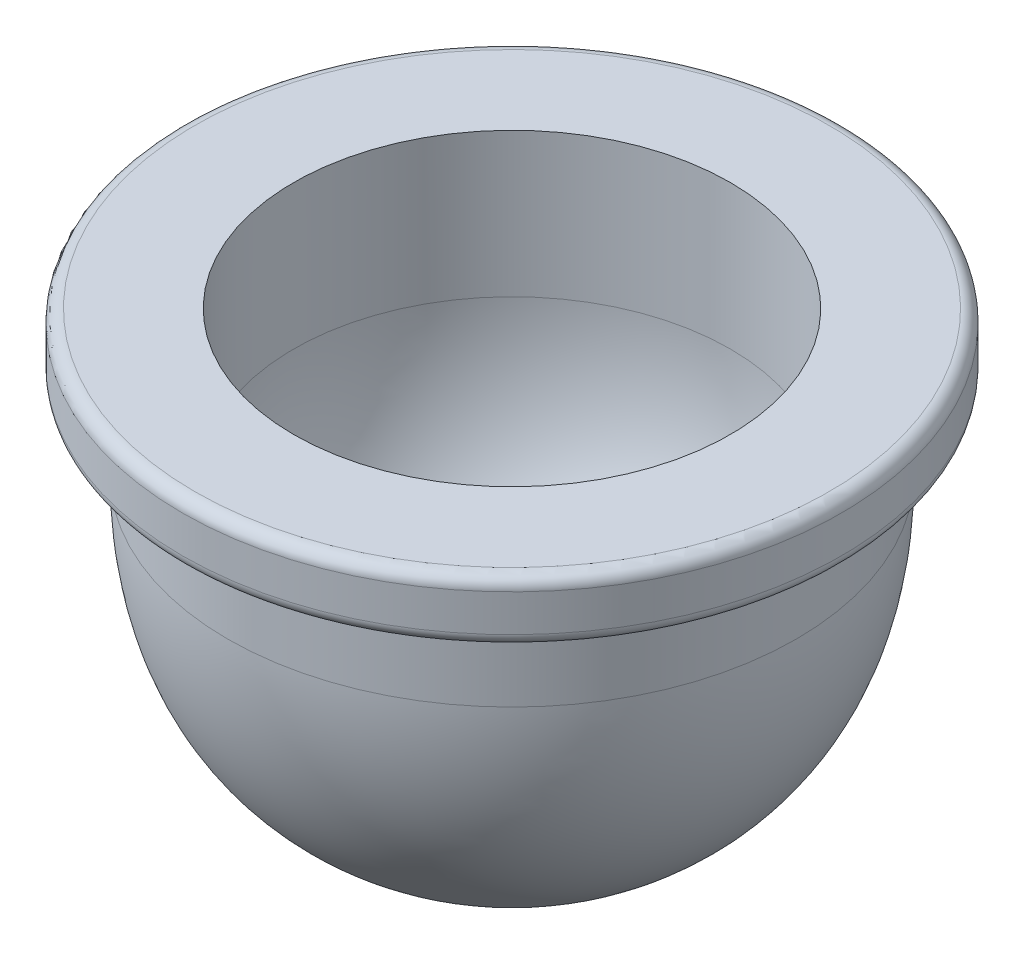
from build123d import *

# Parameters (mm, degrees)
FILLET2_R = 0.3


with BuildPart() as part:
    # Sketch1 → Revolve2 (revolve)
    with BuildSketch(Plane.XY, mode=Mode.PRIVATE) as revolve2_sk:
        with BuildLine():
            Line((6.9, -1.5), (6.899999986, -3.5))
            add(Edge.make_bspline(
                [(6.899999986, -3.5), (6.899999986, -8.642671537), (3.39705755, -11), (0, -11)],
                knots=[0, 0, 0, 0, 1, 1, 1, 1], degree=3))
            Line((0, -11), (0, -9.4))
            add(Edge.make_bspline(
                [(5.299999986, -3.5), (5.299999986, -3.763874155), (5.276508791, -4.308490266), (5.145776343, -5.256949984), (4.84442019, -6.283573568), (4.31283462, -7.266467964), (3.420388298, -8.306429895), (2.003224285, -9.166050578), (0.660558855, -9.4), (0, -9.4)],
                knots=[0, 0, 0, 0, 0.0625, 0.125, 0.25, 0.375, 0.5, 0.75, 1, 1, 1, 1], degree=3))
            Line((5.299999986, -3.5), (5.3, 0))
            Line((5.3, 0), (8, 0))
            Line((8, 0), (8, -1.5))
            Line((8, -1.5), (6.9, -1.5))
        make_face()
    revolve(revolve2_sk.sketch.rotate(Axis((0, -11, 0), (0, 1, 0)), 90), axis=Axis((0, -11, 0), (0, 1, 0)))

    # Fillet2
    fillet2_edges = [part.edges().sort_by_distance(p)[0] for p in [
        (0, 0, 8),
        (0, -1.5, 8),
    ]]
    fillet(fillet2_edges, radius=FILLET2_R)


solid = part.part
